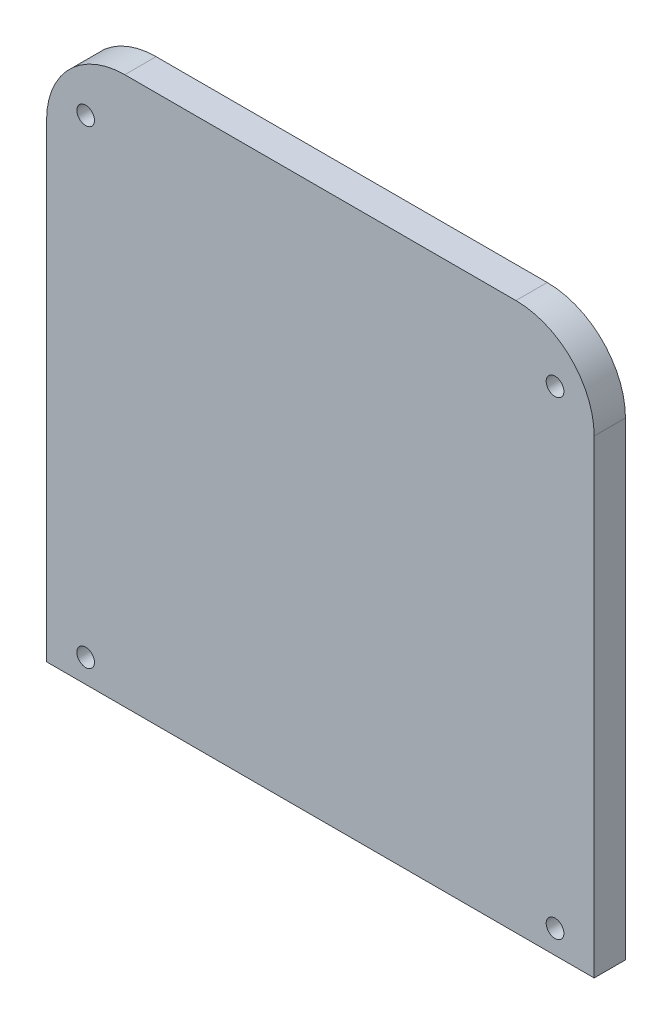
from build123d import *

# Parameters (mm, degrees)
SKETCH1_W             = 70
SKETCH1_H             = 70
BOSS_EXTRUDE1_DEPTH   = 4
F_4_40_TAPPED_HOLE1_D = 2.2606
FILLET6_R             = 10


with BuildPart() as part:
    # Sketch1 → Boss-Extrude1 (new body)
    with BuildSketch(Plane.XY):
        Rectangle(SKETCH1_W, SKETCH1_H)
    extrude(amount=BOSS_EXTRUDE1_DEPTH)

    # 4-40 Tapped Hole1 (through all)
    with Locations(Plane(origin=(0, 0, 0), x_dir=(-1, 0, 0), z_dir=(0, 0, -1))):
        with Locations((-30, 28), (30, -32), (30, 28), (-30, -32)):
            Hole(F_4_40_TAPPED_HOLE1_D / 2)

    # Fillet6
    fillet6_edges = [part.edges().sort_by_distance(p)[0] for p in [
        (-35, 35, 2),
        (35, 35, 2),
    ]]
    fillet(fillet6_edges, radius=FILLET6_R)


solid = part.part
